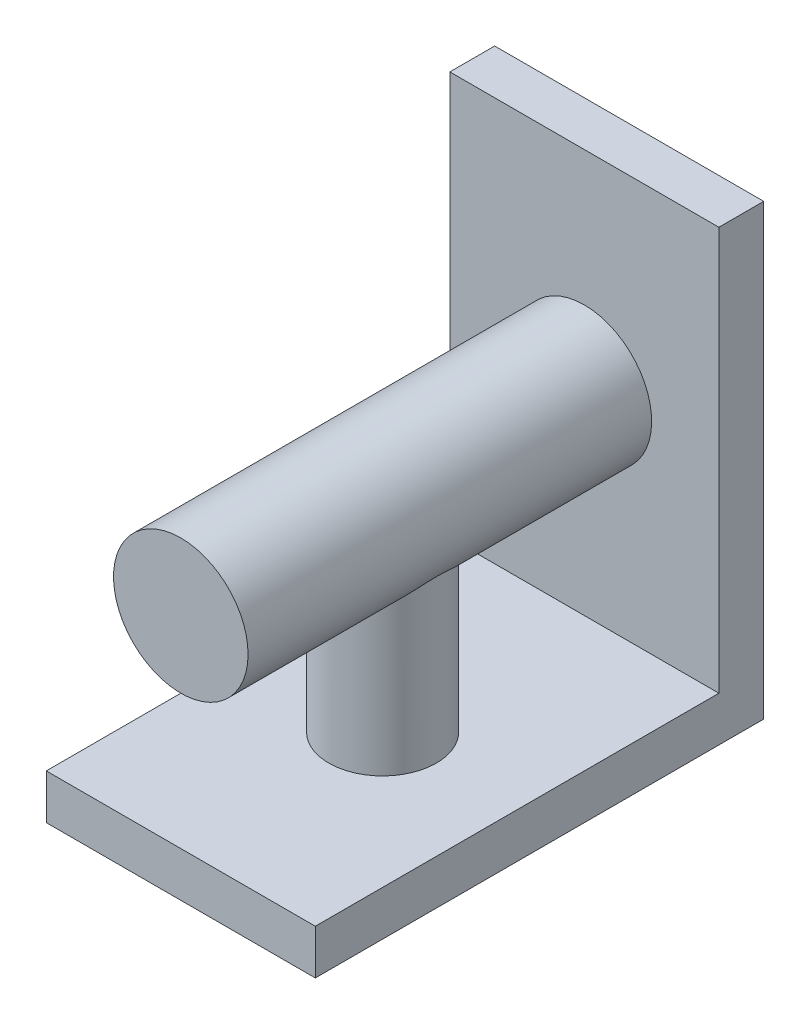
ISO-10303-21;
HEADER;
FILE_DESCRIPTION(('STEP AP214'),'2;1');
FILE_NAME('part.step','',(''),(''),'','','');
FILE_SCHEMA(('AUTOMOTIVE_DESIGN { 1 0 10303 214 1 1 1 1 }'));
ENDSEC;
DATA;
#1=APPLICATION_CONTEXT('core data for automotive mechanical design processes');
#2=APPLICATION_PROTOCOL_DEFINITION('international standard','automotive_design',2000,#1);
#3=PRODUCT_CONTEXT('',#1,'mechanical');
#4=PRODUCT('Part','Part','',(#3));
#5=PRODUCT_RELATED_PRODUCT_CATEGORY('part','',(#4));
#6=PRODUCT_DEFINITION_FORMATION('','',#4);
#7=PRODUCT_DEFINITION_CONTEXT('part definition',#1,'design');
#8=PRODUCT_DEFINITION('design','',#6,#7);
#9=PRODUCT_DEFINITION_SHAPE('','',#8);
#10=(LENGTH_UNIT() NAMED_UNIT(*) SI_UNIT(.MILLI.,.METRE.));
#11=(NAMED_UNIT(*) PLANE_ANGLE_UNIT() SI_UNIT($,.RADIAN.));
#12=(NAMED_UNIT(*) SI_UNIT($,.STERADIAN.) SOLID_ANGLE_UNIT());
#13=UNCERTAINTY_MEASURE_WITH_UNIT(LENGTH_MEASURE(1.E-05),#10,'distance_accuracy_value','');
#14=(GEOMETRIC_REPRESENTATION_CONTEXT(3) GLOBAL_UNCERTAINTY_ASSIGNED_CONTEXT((#13)) GLOBAL_UNIT_ASSIGNED_CONTEXT((#10,
#11,#12)) REPRESENTATION_CONTEXT('',''));
#15=CARTESIAN_POINT('',(0.,0.,0.));
#16=DIRECTION('',(0.,0.,1.));
#17=DIRECTION('',(1.,0.,0.));
#18=AXIS2_PLACEMENT_3D('',#15,#16,#17);
#19=CARTESIAN_POINT('',(15.,5.,-45.));
#20=DIRECTION('',(0.,-1.,0.));
#21=DIRECTION('',(0.,0.,-1.));
#22=AXIS2_PLACEMENT_3D('',#19,#20,#21);
#23=PLANE('',#22);
#24=DIRECTION('',(0.,0.,1.));
#25=VECTOR('',#24,1.);
#26=CARTESIAN_POINT('',(-15.,5.,-45.));
#27=LINE('',#26,#25);
#28=CARTESIAN_POINT('',(-15.,5.,-45.));
#29=VERTEX_POINT('',#28);
#30=CARTESIAN_POINT('',(-15.,5.,0.));
#31=VERTEX_POINT('',#30);
#32=EDGE_CURVE('E119',#29,#31,#27,.T.);
#33=ORIENTED_EDGE('',*,*,#32,.T.);
#34=DIRECTION('',(-1.,0.,0.));
#35=VECTOR('',#34,1.);
#36=CARTESIAN_POINT('',(15.,5.,0.));
#37=LINE('',#36,#35);
#38=CARTESIAN_POINT('',(15.,5.,0.));
#39=VERTEX_POINT('',#38);
#40=EDGE_CURVE('E108',#39,#31,#37,.T.);
#41=ORIENTED_EDGE('',*,*,#40,.F.);
#42=DIRECTION('',(0.,0.,1.));
#43=VECTOR('',#42,1.);
#44=CARTESIAN_POINT('',(15.,5.,-45.));
#45=LINE('',#44,#43);
#46=CARTESIAN_POINT('',(15.,5.,-45.));
#47=VERTEX_POINT('',#46);
#48=EDGE_CURVE('E48',#47,#39,#45,.T.);
#49=ORIENTED_EDGE('',*,*,#48,.F.);
#50=DIRECTION('',(-1.,0.,0.));
#51=VECTOR('',#50,1.);
#52=CARTESIAN_POINT('',(15.,5.,-45.));
#53=LINE('',#52,#51);
#54=EDGE_CURVE('E131',#47,#29,#53,.T.);
#55=ORIENTED_EDGE('',*,*,#54,.T.);
#56=EDGE_LOOP('',(#33,#41,#49,#55));
#57=FACE_BOUND('',#56,.T.);
#58=CARTESIAN_POINT('',(0.,4.99999999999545,-22.5));
#59=DIRECTION('',(0.,-1.,0.));
#60=DIRECTION('',(0.,0.,-1.));
#61=AXIS2_PLACEMENT_3D('',#58,#59,#60);
#62=CIRCLE('',#61,6.);
#63=CARTESIAN_POINT('',(0.,4.99999999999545,-28.5));
#64=VERTEX_POINT('',#63);
#65=EDGE_CURVE('E11',#64,#64,#62,.F.);
#66=ORIENTED_EDGE('',*,*,#65,.F.);
#67=EDGE_LOOP('',(#66));
#68=FACE_BOUND('',#67,.T.);
#69=ADVANCED_FACE('F33',(#57,#68),#23,.F.);
#70=CARTESIAN_POINT('',(0.,27.5,0.));
#71=DIRECTION('',(0.,0.,-1.));
#72=DIRECTION('',(-1.,0.,0.));
#73=AXIS2_PLACEMENT_3D('',#70,#71,#72);
#74=CYLINDRICAL_SURFACE('',#73,7.5);
#75=CARTESIAN_POINT('',(0.,27.5,-45.));
#76=DIRECTION('',(0.,0.,-1.));
#77=DIRECTION('',(0.,1.,0.));
#78=AXIS2_PLACEMENT_3D('',#75,#76,#77);
#79=CIRCLE('',#78,7.5);
#80=CARTESIAN_POINT('',(0.,35.,-45.));
#81=VERTEX_POINT('',#80);
#82=EDGE_CURVE('E104',#81,#81,#79,.F.);
#83=ORIENTED_EDGE('',*,*,#82,.T.);
#84=EDGE_LOOP('',(#83));
#85=FACE_BOUND('',#84,.T.);
#86=CARTESIAN_POINT('',(0.,27.5,0.));
#87=DIRECTION('',(0.,0.,1.));
#88=DIRECTION('',(1.,0.,0.));
#89=AXIS2_PLACEMENT_3D('',#86,#87,#88);
#90=CIRCLE('',#89,7.5);
#91=CARTESIAN_POINT('',(7.5,27.5,0.));
#92=VERTEX_POINT('',#91);
#93=EDGE_CURVE('E109',#92,#92,#90,.T.);
#94=ORIENTED_EDGE('',*,*,#93,.F.);
#95=EDGE_LOOP('',(#94));
#96=FACE_BOUND('',#95,.T.);
#97=CARTESIAN_POINT('',(0.,19.999999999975,-28.5));
#98=CARTESIAN_POINT('',(0.144069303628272,20.0000011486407,-28.4999988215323));
#99=CARTESIAN_POINT('',(0.288160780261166,20.0041606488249,-28.4948016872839));
#100=CARTESIAN_POINT('',(0.575186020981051,20.0207055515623,-28.4741010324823));
#101=CARTESIAN_POINT('',(0.718119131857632,20.0330953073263,-28.4585920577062));
#102=CARTESIAN_POINT('',(1.00184192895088,20.0658398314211,-28.4175072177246));
#103=CARTESIAN_POINT('',(1.14262773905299,20.0862075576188,-28.391914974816));
#104=CARTESIAN_POINT('',(1.4208387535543,20.1344609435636,-28.3310812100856));
#105=CARTESIAN_POINT('',(1.55826238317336,20.1623500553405,-28.2958352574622));
#106=CARTESIAN_POINT('',(1.82787977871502,20.2248458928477,-28.2165077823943));
#107=CARTESIAN_POINT('',(1.9601031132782,20.2594048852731,-28.1724889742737));
#108=CARTESIAN_POINT('',(2.21965420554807,20.3347064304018,-28.0760499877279));
#109=CARTESIAN_POINT('',(2.34697979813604,20.3754516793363,-28.0236261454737));
#110=CARTESIAN_POINT('',(2.72065069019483,20.5058964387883,-27.8546852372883));
#111=CARTESIAN_POINT('',(2.95896665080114,20.6038712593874,-27.7264157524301));
#112=CARTESIAN_POINT('',(3.33732730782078,20.7813152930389,-27.4894591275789));
#113=CARTESIAN_POINT('',(3.48412297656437,20.8564382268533,-27.3879731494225));
#114=CARTESIAN_POINT('',(3.76631562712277,21.0122579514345,-27.1739900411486));
#115=CARTESIAN_POINT('',(3.90171307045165,21.092954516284,-27.0614933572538));
#116=CARTESIAN_POINT('',(4.16124048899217,21.2583783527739,-26.8260698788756));
#117=CARTESIAN_POINT('',(4.28533743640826,21.3431164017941,-26.7031144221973));
#118=CARTESIAN_POINT('',(4.52173957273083,21.514585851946,-26.4476766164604));
#119=CARTESIAN_POINT('',(4.63404610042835,21.6013170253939,-26.3151953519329));
#120=CARTESIAN_POINT('',(4.84843529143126,21.7761810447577,-26.0388888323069));
#121=CARTESIAN_POINT('',(4.95033048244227,21.8643145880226,-25.894918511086));
#122=CARTESIAN_POINT('',(5.14165482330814,22.0383058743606,-25.597525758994));
#123=CARTESIAN_POINT('',(5.23108003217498,22.1241628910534,-25.4441003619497));
#124=CARTESIAN_POINT('',(5.39673779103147,22.2904940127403,-25.1281064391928));
#125=CARTESIAN_POINT('',(5.47300606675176,22.3709823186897,-24.9655643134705));
#126=CARTESIAN_POINT('',(5.61176721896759,22.5231876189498,-24.6309344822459));
#127=CARTESIAN_POINT('',(5.674271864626,22.5949120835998,-24.4588550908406));
#128=CARTESIAN_POINT('',(5.79257491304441,22.7349485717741,-24.0783977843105));
#129=CARTESIAN_POINT('',(5.84597586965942,22.8011494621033,-23.868437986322));
#130=CARTESIAN_POINT('',(5.90918700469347,22.8812701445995,-23.5457191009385));
#131=CARTESIAN_POINT('',(5.92743581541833,22.9047710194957,-23.4369243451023));
#132=CARTESIAN_POINT('',(5.95801048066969,22.9444822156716,-23.2172117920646));
#133=CARTESIAN_POINT('',(5.97033922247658,22.9606960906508,-23.1062950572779));
#134=CARTESIAN_POINT('',(5.98889186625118,22.9852003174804,-22.8820332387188));
#135=CARTESIAN_POINT('',(5.99505860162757,22.9934164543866,-22.7686752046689));
#136=CARTESIAN_POINT('',(6.00093215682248,23.0012403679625,-22.5414952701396));
#137=CARTESIAN_POINT('',(6.00063929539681,23.0008485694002,-22.4276733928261));
#138=CARTESIAN_POINT('',(5.99359960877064,22.9914750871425,-22.2005294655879));
#139=CARTESIAN_POINT('',(5.98684936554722,22.9824888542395,-22.0872077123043));
#140=CARTESIAN_POINT('',(5.96705700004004,22.9563786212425,-21.8620198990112));
#141=CARTESIAN_POINT('',(5.95401153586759,22.939250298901,-21.7501546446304));
#142=CARTESIAN_POINT('',(5.91941212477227,22.8944076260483,-21.5114224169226));
#143=CARTESIAN_POINT('',(5.89684898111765,22.8654594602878,-21.3849346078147));
#144=CARTESIAN_POINT('',(5.84422014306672,22.7992689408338,-21.1356913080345));
#145=CARTESIAN_POINT('',(5.81414884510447,22.7620203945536,-21.0129386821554));
#146=CARTESIAN_POINT('',(5.7469620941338,22.6807460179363,-20.771363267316));
#147=CARTESIAN_POINT('',(5.70983012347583,22.636704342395,-20.6525504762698));
#148=CARTESIAN_POINT('',(5.62903988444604,22.5434164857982,-20.4193422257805));
#149=CARTESIAN_POINT('',(5.58538324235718,22.4941716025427,-20.3049456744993));
#150=CARTESIAN_POINT('',(5.46892283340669,22.3666242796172,-20.0253762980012));
#151=CARTESIAN_POINT('',(5.39233519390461,22.2859302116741,-19.862862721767));
#152=CARTESIAN_POINT('',(5.22622677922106,22.1194418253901,-19.5473124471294));
#153=CARTESIAN_POINT('',(5.13670002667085,22.033645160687,-19.3942801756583));
#154=CARTESIAN_POINT('',(4.94506924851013,21.8596934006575,-19.0974229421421));
#155=CARTESIAN_POINT('',(4.84295064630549,21.7715356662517,-18.9536089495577));
#156=CARTESIAN_POINT('',(4.62647038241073,21.5953192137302,-18.675497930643));
#157=CARTESIAN_POINT('',(4.51211073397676,21.507260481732,-18.5411993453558));
#158=CARTESIAN_POINT('',(4.26801695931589,21.3309397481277,-18.2789852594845));
#159=CARTESIAN_POINT('',(4.13795303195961,21.2427354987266,-18.1513371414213));
#160=CARTESIAN_POINT('',(3.8651078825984,21.0706173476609,-17.9071296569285));
#161=CARTESIAN_POINT('',(3.72232479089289,20.9867040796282,-17.7905719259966));
#162=CARTESIAN_POINT('',(3.42462217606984,20.8253791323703,-17.5698664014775));
#163=CARTESIAN_POINT('',(3.26973119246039,20.7479530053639,-17.465690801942));
#164=CARTESIAN_POINT('',(2.94802228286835,20.6014227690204,-17.270803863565));
#165=CARTESIAN_POINT('',(2.7812097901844,20.5323149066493,-17.1800864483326));
#166=CARTESIAN_POINT('',(2.4861036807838,20.4228216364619,-17.0375933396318));
#167=CARTESIAN_POINT('',(2.36052516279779,20.3798909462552,-16.9821205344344));
#168=CARTESIAN_POINT('',(2.10423055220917,20.2999848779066,-16.8793896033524));
#169=CARTESIAN_POINT('',(1.97351574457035,20.2630080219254,-16.8321294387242));
#170=CARTESIAN_POINT('',(1.70762454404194,20.1956988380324,-16.7464343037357));
#171=CARTESIAN_POINT('',(1.57245040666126,20.1653632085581,-16.707994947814));
#172=CARTESIAN_POINT('',(1.29837111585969,20.1119202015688,-16.6404650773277));
#173=CARTESIAN_POINT('',(1.15946586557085,20.0888130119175,-16.6113748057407));
#174=CARTESIAN_POINT('',(0.878150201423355,20.0502273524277,-16.5628854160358));
#175=CARTESIAN_POINT('',(0.735725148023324,20.034789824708,-16.5435383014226));
#176=CARTESIAN_POINT('',(0.449202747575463,20.0120852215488,-16.5151072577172));
#177=CARTESIAN_POINT('',(0.305105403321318,20.0048181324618,-16.5060233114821));
#178=CARTESIAN_POINT('',(0.0164711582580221,19.9986293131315,-16.4982862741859));
#179=CARTESIAN_POINT('',(-0.128065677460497,19.9997064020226,-16.4996317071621));
#180=CARTESIAN_POINT('',(-0.416355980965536,20.0101766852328,-16.5127244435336));
#181=CARTESIAN_POINT('',(-0.560109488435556,20.0195694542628,-16.5244712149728));
#182=CARTESIAN_POINT('',(-0.834022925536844,20.0453533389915,-16.5567817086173));
#183=CARTESIAN_POINT('',(-0.964337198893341,20.0611128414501,-16.5765502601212));
#184=CARTESIAN_POINT('',(-1.22248257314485,20.0991493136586,-16.6243896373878));
#185=CARTESIAN_POINT('',(-1.35031282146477,20.1214284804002,-16.6524632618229));
#186=CARTESIAN_POINT('',(-1.72886824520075,20.1974607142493,-16.7485957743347));
#187=CARTESIAN_POINT('',(-1.97484531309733,20.2604269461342,-16.8285890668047));
#188=CARTESIAN_POINT('',(-2.46374957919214,20.4113097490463,-17.0224583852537));
#189=CARTESIAN_POINT('',(-2.70554735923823,20.5005285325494,-17.1381239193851));
#190=CARTESIAN_POINT('',(-3.16621351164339,20.6964854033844,-17.3965798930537));
#191=CARTESIAN_POINT('',(-3.3850807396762,20.8032243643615,-17.5393716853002));
#192=CARTESIAN_POINT('',(-3.8377857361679,21.050211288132,-17.877695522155));
#193=CARTESIAN_POINT('',(-4.06662349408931,21.1929784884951,-18.0780945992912));
#194=CARTESIAN_POINT('',(-4.3837063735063,21.4131439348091,-18.4004948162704));
#195=CARTESIAN_POINT('',(-4.48519600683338,21.4876733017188,-18.5118134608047));
#196=CARTESIAN_POINT('',(-4.67930465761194,21.6374823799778,-18.7414499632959));
#197=CARTESIAN_POINT('',(-4.7719256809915,21.7127619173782,-18.8597662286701));
#198=CARTESIAN_POINT('',(-4.96703582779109,21.8787659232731,-19.1292662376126));
#199=CARTESIAN_POINT('',(-5.06740723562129,21.9693549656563,-19.2820724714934));
#200=CARTESIAN_POINT('',(-5.25465507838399,22.1469402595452,-19.5978760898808));
#201=CARTESIAN_POINT('',(-5.34152435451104,22.2339345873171,-19.7608788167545));
#202=CARTESIAN_POINT('',(-5.50076193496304,22.4005056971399,-20.0966676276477));
#203=CARTESIAN_POINT('',(-5.57318026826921,22.480107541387,-20.2694172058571));
#204=CARTESIAN_POINT('',(-5.70268405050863,22.627729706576,-20.6251128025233));
#205=CARTESIAN_POINT('',(-5.75978841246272,22.6957642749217,-20.8080459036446));
#206=CARTESIAN_POINT('',(-5.86080595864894,22.8194146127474,-21.1982976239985));
#207=CARTESIAN_POINT('',(-5.90339100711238,22.8736979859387,-21.4064135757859));
#208=CARTESIAN_POINT('',(-5.9506581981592,22.9348809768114,-21.7246364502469));
#209=CARTESIAN_POINT('',(-5.96364228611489,22.9518968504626,-21.8316429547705));
#210=CARTESIAN_POINT('',(-5.98385825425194,22.9785259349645,-22.0470939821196));
#211=CARTESIAN_POINT('',(-5.99109267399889,22.9881424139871,-22.1555378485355));
#212=CARTESIAN_POINT('',(-5.99966933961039,22.9995534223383,-22.3736896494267));
#213=CARTESIAN_POINT('',(-6.00097790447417,23.0013032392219,-22.4834012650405));
#214=CARTESIAN_POINT('',(-5.99758108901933,22.9967757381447,-22.7025613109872));
#215=CARTESIAN_POINT('',(-5.99287581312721,22.9904985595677,-22.812009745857));
#216=CARTESIAN_POINT('',(-5.97755458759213,22.9702096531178,-23.0298905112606));
#217=CARTESIAN_POINT('',(-5.9669316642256,22.9561887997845,-23.1383214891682));
#218=CARTESIAN_POINT('',(-5.93999622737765,22.9210337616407,-23.3533447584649));
#219=CARTESIAN_POINT('',(-5.92368066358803,22.8998957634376,-23.4599360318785));
#220=CARTESIAN_POINT('',(-5.88045271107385,22.8447000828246,-23.6995296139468));
#221=CARTESIAN_POINT('',(-5.85186240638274,22.8086899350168,-23.8317796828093));
#222=CARTESIAN_POINT('',(-5.78656602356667,22.7283832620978,-24.0917428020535));
#223=CARTESIAN_POINT('',(-5.74985321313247,22.6840798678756,-24.2194519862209));
#224=CARTESIAN_POINT('',(-5.66881462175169,22.5889460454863,-24.4702668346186));
#225=CARTESIAN_POINT('',(-5.62447130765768,22.5381006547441,-24.5933610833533));
#226=CARTESIAN_POINT('',(-5.5287184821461,22.4316272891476,-24.8345455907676));
#227=CARTESIAN_POINT('',(-5.47731106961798,22.3760007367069,-24.9526373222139));
#228=CARTESIAN_POINT('',(-5.34287483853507,22.235310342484,-25.2364825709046));
#229=CARTESIAN_POINT('',(-5.25608789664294,22.1483504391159,-25.3995256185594));
#230=CARTESIAN_POINT('',(-5.06893309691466,21.9707515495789,-25.7155329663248));
#231=CARTESIAN_POINT('',(-4.96855971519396,21.8801110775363,-25.868493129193));
#232=CARTESIAN_POINT('',(-4.75448637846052,21.6978761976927,-26.1644560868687));
#233=CARTESIAN_POINT('',(-4.64077383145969,21.6062809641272,-26.3074492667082));
#234=CARTESIAN_POINT('',(-4.40028302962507,21.4246217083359,-26.5830064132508));
#235=CARTESIAN_POINT('',(-4.27350684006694,21.3345574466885,-26.7155720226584));
#236=CARTESIAN_POINT('',(-4.00521183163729,21.1569325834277,-26.9713620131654));
#237=CARTESIAN_POINT('',(-3.86352020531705,21.0694208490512,-27.0944396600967));
#238=CARTESIAN_POINT('',(-3.56696232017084,20.9003094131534,-27.3282950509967));
#239=CARTESIAN_POINT('',(-3.4120938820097,20.8187106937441,-27.4390707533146));
#240=CARTESIAN_POINT('',(-3.08999567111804,20.6637883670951,-27.646702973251));
#241=CARTESIAN_POINT('',(-2.92279669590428,20.5904452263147,-27.7435925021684));
#242=CARTESIAN_POINT('',(-2.57653400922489,20.4540052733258,-27.9221171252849));
#243=CARTESIAN_POINT('',(-2.39747765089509,20.3909021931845,-28.0037615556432));
#244=CARTESIAN_POINT('',(-2.08908357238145,20.2956525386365,-28.1261507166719));
#245=CARTESIAN_POINT('',(-1.96261051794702,20.2601271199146,-28.1715438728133));
#246=CARTESIAN_POINT('',(-1.70546789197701,20.1952793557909,-28.254093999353));
#247=CARTESIAN_POINT('',(-1.57479944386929,20.1659553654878,-28.2912531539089));
#248=CARTESIAN_POINT('',(-1.31025905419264,20.1141112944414,-28.3567697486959));
#249=CARTESIAN_POINT('',(-1.17639466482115,20.0915766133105,-28.3851460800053));
#250=CARTESIAN_POINT('',(-0.906095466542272,20.053685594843,-28.4327739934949));
#251=CARTESIAN_POINT('',(-0.769661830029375,20.0383260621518,-28.4520296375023));
#252=CARTESIAN_POINT('',(-0.527666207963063,20.0178458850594,-28.4776812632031));
#253=CARTESIAN_POINT('',(-0.422438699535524,20.011162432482,-28.4860420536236));
#254=CARTESIAN_POINT('',(-0.211478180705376,20.0022385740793,-28.4972024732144));
#255=CARTESIAN_POINT('',(-0.105745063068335,19.9999991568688,-28.5000008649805));
#256=CARTESIAN_POINT('',(0.,19.999999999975,-28.5));
#257=B_SPLINE_CURVE_WITH_KNOTS('',3,(#97,#98,#99,#100,#101,#102,#103,#104,#105,#106,#107,#108,
#109,#110,#111,#112,#113,#114,#115,#116,#117,#118,#119,#120,#121,#122,#123,#124,#125,#126,#127,
#128,#129,#130,#131,#132,#133,#134,#135,#136,#137,#138,#139,#140,#141,#142,#143,#144,#145,#146,
#147,#148,#149,#150,#151,#152,#153,#154,#155,#156,#157,#158,#159,#160,#161,#162,#163,#164,#165,
#166,#167,#168,#169,#170,#171,#172,#173,#174,#175,#176,#177,#178,#179,#180,#181,#182,#183,#184,
#185,#186,#187,#188,#189,#190,#191,#192,#193,#194,#195,#196,#197,#198,#199,#200,#201,#202,#203,
#204,#205,#206,#207,#208,#209,#210,#211,#212,#213,#214,#215,#216,#217,#218,#219,#220,#221,#222,
#223,#224,#225,#226,#227,#228,#229,#230,#231,#232,#233,#234,#235,#236,#237,#238,#239,#240,#241,
#242,#243,#244,#245,#246,#247,#248,#249,#250,#251,#252,#253,#254,#255,#256),.UNSPECIFIED.,.T.,
.F.,(4,2,2,2,2,2,2,2,2,2,2,2,2,2,2,2,2,2,2,2,2,2,2,2,2,2,2,2,2,2,2,2,2,2,2,2,2,2,2,2,2,2,2,2,2,
2,2,2,2,2,2,2,2,2,2,2,2,2,2,2,2,2,2,2,2,2,2,2,2,2,2,2,2,2,2,2,2,2,2,4),(0.,0.432094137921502,
0.864417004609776,1.29744498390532,1.73067204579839,2.16090654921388,2.59132910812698,
3.45129492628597,4.03154335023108,4.61176826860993,5.19363794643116,5.77544148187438,
6.36634865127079,6.95744214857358,7.54690445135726,8.13586073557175,8.81281653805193,
9.15084630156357,9.48871103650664,9.82968191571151,10.1706359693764,10.5117705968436,
10.853086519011,11.2475975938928,11.6424039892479,12.03814561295,12.4337887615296,
13.023766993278,13.6140186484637,14.2049601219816,14.7958045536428,15.4024774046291,
16.0092395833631,16.6146123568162,17.2197109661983,17.6508312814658,18.0818444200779,
18.5126427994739,18.94345237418,19.3765376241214,19.8096221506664,20.2426453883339,
20.6756464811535,21.0734159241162,21.4713195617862,22.2665649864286,23.1109920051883,
23.9554611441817,24.9596755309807,25.4635849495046,25.9673801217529,26.5787810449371,
27.1905050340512,27.8000730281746,28.408884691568,29.0638482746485,29.390878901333,
29.7177650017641,30.0465067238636,30.3752427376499,30.7043669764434,31.033667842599,
31.4530571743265,31.8727954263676,32.2935113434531,32.7141025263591,33.3257008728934,
33.9375486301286,34.5499786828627,35.1623120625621,35.782744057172,36.4032788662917,
37.02231311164,37.6409670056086,38.0575384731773,38.4739993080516,38.8895580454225,
39.3049315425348,39.6220126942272,39.9391643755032),.UNSPECIFIED.);
#258=CARTESIAN_POINT('',(0.,19.999999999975,-28.5));
#259=VERTEX_POINT('',#258);
#260=EDGE_CURVE('E41',#259,#259,#257,.T.);
#261=ORIENTED_EDGE('',*,*,#260,.F.);
#262=EDGE_LOOP('',(#261));
#263=FACE_BOUND('',#262,.T.);
#264=ADVANCED_FACE('F147',(#85,#96,#263),#74,.T.);
#265=CARTESIAN_POINT('',(15.,50.,-45.));
#266=DIRECTION('',(0.,0.,-1.));
#267=DIRECTION('',(0.,1.,0.));
#268=AXIS2_PLACEMENT_3D('',#265,#266,#267);
#269=PLANE('',#268);
#270=DIRECTION('',(0.,-1.,0.));
#271=VECTOR('',#270,1.);
#272=CARTESIAN_POINT('',(-15.,50.,-45.));
#273=LINE('',#272,#271);
#274=CARTESIAN_POINT('',(-15.,50.,-45.));
#275=VERTEX_POINT('',#274);
#276=EDGE_CURVE('E117',#275,#29,#273,.T.);
#277=ORIENTED_EDGE('',*,*,#276,.T.);
#278=ORIENTED_EDGE('',*,*,#54,.F.);
#279=DIRECTION('',(0.,-1.,0.));
#280=VECTOR('',#279,1.);
#281=CARTESIAN_POINT('',(15.,50.,-45.));
#282=LINE('',#281,#280);
#283=CARTESIAN_POINT('',(15.,50.,-45.));
#284=VERTEX_POINT('',#283);
#285=EDGE_CURVE('E53',#284,#47,#282,.T.);
#286=ORIENTED_EDGE('',*,*,#285,.F.);
#287=DIRECTION('',(-1.,0.,0.));
#288=VECTOR('',#287,1.);
#289=CARTESIAN_POINT('',(15.,50.,-45.));
#290=LINE('',#289,#288);
#291=EDGE_CURVE('E134',#284,#275,#290,.T.);
#292=ORIENTED_EDGE('',*,*,#291,.T.);
#293=EDGE_LOOP('',(#277,#278,#286,#292));
#294=FACE_BOUND('',#293,.T.);
#295=ORIENTED_EDGE('',*,*,#82,.F.);
#296=EDGE_LOOP('',(#295));
#297=FACE_BOUND('',#296,.T.);
#298=ADVANCED_FACE('F168',(#294,#297),#269,.F.);
#299=CARTESIAN_POINT('',(15.,5.,0.));
#300=DIRECTION('',(0.,0.,-1.));
#301=DIRECTION('',(0.,1.,0.));
#302=AXIS2_PLACEMENT_3D('',#299,#300,#301);
#303=PLANE('',#302);
#304=DIRECTION('',(0.,-1.,0.));
#305=VECTOR('',#304,1.);
#306=CARTESIAN_POINT('',(-15.,5.,0.));
#307=LINE('',#306,#305);
#308=CARTESIAN_POINT('',(-15.,0.,0.));
#309=VERTEX_POINT('',#308);
#310=EDGE_CURVE('E91',#31,#309,#307,.T.);
#311=ORIENTED_EDGE('',*,*,#310,.T.);
#312=DIRECTION('',(-1.,0.,0.));
#313=VECTOR('',#312,1.);
#314=CARTESIAN_POINT('',(15.,0.,0.));
#315=LINE('',#314,#313);
#316=CARTESIAN_POINT('',(15.,0.,0.));
#317=VERTEX_POINT('',#316);
#318=EDGE_CURVE('E99',#317,#309,#315,.T.);
#319=ORIENTED_EDGE('',*,*,#318,.F.);
#320=DIRECTION('',(0.,-1.,0.));
#321=VECTOR('',#320,1.);
#322=CARTESIAN_POINT('',(15.,5.,0.));
#323=LINE('',#322,#321);
#324=EDGE_CURVE('E121',#39,#317,#323,.T.);
#325=ORIENTED_EDGE('',*,*,#324,.F.);
#326=ORIENTED_EDGE('',*,*,#40,.T.);
#327=EDGE_LOOP('',(#311,#319,#325,#326));
#328=FACE_BOUND('',#327,.T.);
#329=ADVANCED_FACE('F35',(#328),#303,.F.);
#330=CARTESIAN_POINT('',(15.,0.,0.));
#331=DIRECTION('',(0.,1.,0.));
#332=DIRECTION('',(0.,0.,1.));
#333=AXIS2_PLACEMENT_3D('',#330,#331,#332);
#334=PLANE('',#333);
#335=DIRECTION('',(0.,0.,-1.));
#336=VECTOR('',#335,1.);
#337=CARTESIAN_POINT('',(-15.,0.,0.));
#338=LINE('',#337,#336);
#339=CARTESIAN_POINT('',(-15.,0.,-50.));
#340=VERTEX_POINT('',#339);
#341=EDGE_CURVE('E86',#309,#340,#338,.T.);
#342=ORIENTED_EDGE('',*,*,#341,.T.);
#343=DIRECTION('',(-1.,0.,0.));
#344=VECTOR('',#343,1.);
#345=CARTESIAN_POINT('',(15.,0.,-50.));
#346=LINE('',#345,#344);
#347=CARTESIAN_POINT('',(15.,0.,-50.));
#348=VERTEX_POINT('',#347);
#349=EDGE_CURVE('E105',#348,#340,#346,.T.);
#350=ORIENTED_EDGE('',*,*,#349,.F.);
#351=DIRECTION('',(0.,0.,-1.));
#352=VECTOR('',#351,1.);
#353=CARTESIAN_POINT('',(15.,0.,0.));
#354=LINE('',#353,#352);
#355=EDGE_CURVE('E101',#317,#348,#354,.T.);
#356=ORIENTED_EDGE('',*,*,#355,.F.);
#357=ORIENTED_EDGE('',*,*,#318,.T.);
#358=EDGE_LOOP('',(#342,#350,#356,#357));
#359=FACE_BOUND('',#358,.T.);
#360=ADVANCED_FACE('F100',(#359),#334,.F.);
#361=CARTESIAN_POINT('',(15.,0.,-50.));
#362=DIRECTION('',(0.,0.,1.));
#363=DIRECTION('',(1.,0.,0.));
#364=AXIS2_PLACEMENT_3D('',#361,#362,#363);
#365=PLANE('',#364);
#366=DIRECTION('',(0.,1.,0.));
#367=VECTOR('',#366,1.);
#368=CARTESIAN_POINT('',(-15.,0.,-50.));
#369=LINE('',#368,#367);
#370=CARTESIAN_POINT('',(-15.,50.,-50.));
#371=VERTEX_POINT('',#370);
#372=EDGE_CURVE('E93',#340,#371,#369,.T.);
#373=ORIENTED_EDGE('',*,*,#372,.T.);
#374=DIRECTION('',(-1.,0.,0.));
#375=VECTOR('',#374,1.);
#376=CARTESIAN_POINT('',(15.,50.,-50.));
#377=LINE('',#376,#375);
#378=CARTESIAN_POINT('',(15.,50.,-50.));
#379=VERTEX_POINT('',#378);
#380=EDGE_CURVE('E137',#379,#371,#377,.T.);
#381=ORIENTED_EDGE('',*,*,#380,.F.);
#382=DIRECTION('',(0.,1.,0.));
#383=VECTOR('',#382,1.);
#384=CARTESIAN_POINT('',(15.,0.,-50.));
#385=LINE('',#384,#383);
#386=EDGE_CURVE('E124',#348,#379,#385,.T.);
#387=ORIENTED_EDGE('',*,*,#386,.F.);
#388=ORIENTED_EDGE('',*,*,#349,.T.);
#389=EDGE_LOOP('',(#373,#381,#387,#388));
#390=FACE_BOUND('',#389,.T.);
#391=ADVANCED_FACE('F179',(#390),#365,.F.);
#392=CARTESIAN_POINT('',(15.,50.,-50.));
#393=DIRECTION('',(0.,-1.,0.));
#394=DIRECTION('',(0.,0.,-1.));
#395=AXIS2_PLACEMENT_3D('',#392,#393,#394);
#396=PLANE('',#395);
#397=DIRECTION('',(0.,0.,1.));
#398=VECTOR('',#397,1.);
#399=CARTESIAN_POINT('',(-15.,50.,-50.));
#400=LINE('',#399,#398);
#401=EDGE_CURVE('E115',#371,#275,#400,.T.);
#402=ORIENTED_EDGE('',*,*,#401,.T.);
#403=ORIENTED_EDGE('',*,*,#291,.F.);
#404=DIRECTION('',(0.,0.,1.));
#405=VECTOR('',#404,1.);
#406=CARTESIAN_POINT('',(15.,50.,-50.));
#407=LINE('',#406,#405);
#408=EDGE_CURVE('E126',#379,#284,#407,.T.);
#409=ORIENTED_EDGE('',*,*,#408,.F.);
#410=ORIENTED_EDGE('',*,*,#380,.T.);
#411=EDGE_LOOP('',(#402,#403,#409,#410));
#412=FACE_BOUND('',#411,.T.);
#413=ADVANCED_FACE('F176',(#412),#396,.F.);
#414=CARTESIAN_POINT('',(15.,0.,0.));
#415=DIRECTION('',(1.,0.,0.));
#416=DIRECTION('',(0.,0.,-1.));
#417=AXIS2_PLACEMENT_3D('',#414,#415,#416);
#418=PLANE('',#417);
#419=ORIENTED_EDGE('',*,*,#324,.T.);
#420=ORIENTED_EDGE('',*,*,#355,.T.);
#421=ORIENTED_EDGE('',*,*,#386,.T.);
#422=ORIENTED_EDGE('',*,*,#408,.T.);
#423=ORIENTED_EDGE('',*,*,#285,.T.);
#424=ORIENTED_EDGE('',*,*,#48,.T.);
#425=EDGE_LOOP('',(#419,#420,#421,#422,#423,#424));
#426=FACE_BOUND('',#425,.T.);
#427=ADVANCED_FACE('F161',(#426),#418,.T.);
#428=CARTESIAN_POINT('',(-15.,0.,0.));
#429=DIRECTION('',(1.,0.,0.));
#430=DIRECTION('',(0.,0.,-1.));
#431=AXIS2_PLACEMENT_3D('',#428,#429,#430);
#432=PLANE('',#431);
#433=ORIENTED_EDGE('',*,*,#310,.F.);
#434=ORIENTED_EDGE('',*,*,#32,.F.);
#435=ORIENTED_EDGE('',*,*,#276,.F.);
#436=ORIENTED_EDGE('',*,*,#401,.F.);
#437=ORIENTED_EDGE('',*,*,#372,.F.);
#438=ORIENTED_EDGE('',*,*,#341,.F.);
#439=EDGE_LOOP('',(#433,#434,#435,#436,#437,#438));
#440=FACE_BOUND('',#439,.T.);
#441=ADVANCED_FACE('F88',(#440),#432,.F.);
#442=CARTESIAN_POINT('',(0.,27.5,0.));
#443=DIRECTION('',(0.,0.,1.));
#444=DIRECTION('',(1.,0.,0.));
#445=AXIS2_PLACEMENT_3D('',#442,#443,#444);
#446=PLANE('',#445);
#447=ORIENTED_EDGE('',*,*,#93,.T.);
#448=EDGE_LOOP('',(#447));
#449=FACE_BOUND('',#448,.T.);
#450=ADVANCED_FACE('F154',(#449),#446,.T.);
#451=CARTESIAN_POINT('',(0.,500000.,-22.4999999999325));
#452=DIRECTION('',(0.,-1.,0.));
#453=DIRECTION('',(0.,0.,-1.));
#454=AXIS2_PLACEMENT_3D('',#451,#452,#453);
#455=CYLINDRICAL_SURFACE('',#454,6.);
#456=ORIENTED_EDGE('',*,*,#65,.T.);
#457=EDGE_LOOP('',(#456));
#458=FACE_BOUND('',#457,.T.);
#459=ORIENTED_EDGE('',*,*,#260,.T.);
#460=EDGE_LOOP('',(#459));
#461=FACE_BOUND('',#460,.T.);
#462=ADVANCED_FACE('F151',(#458,#461),#455,.T.);
#463=CLOSED_SHELL('',(#69,#264,#298,#329,#360,#391,#413,#427,#441,#450,#462));
#464=MANIFOLD_SOLID_BREP('B2',#463);
#465=ADVANCED_BREP_SHAPE_REPRESENTATION('',(#18,#464),#14);
#466=SHAPE_DEFINITION_REPRESENTATION(#9,#465);
ENDSEC;
END-ISO-10303-21;
